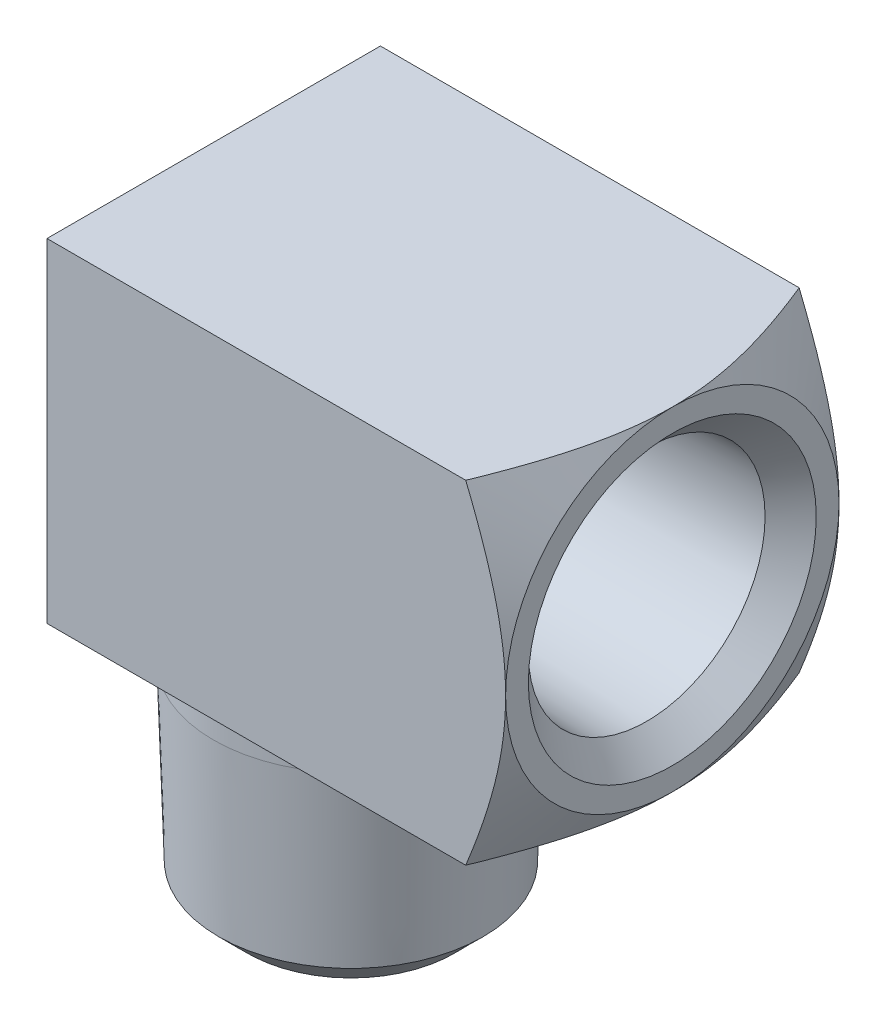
ISO-10303-21;
HEADER;
FILE_DESCRIPTION(('STEP AP214'),'2;1');
FILE_NAME('part.step','',(''),(''),'','','');
FILE_SCHEMA(('AUTOMOTIVE_DESIGN { 1 0 10303 214 1 1 1 1 }'));
ENDSEC;
DATA;
#1=APPLICATION_CONTEXT('core data for automotive mechanical design processes');
#2=APPLICATION_PROTOCOL_DEFINITION('international standard','automotive_design',2000,#1);
#3=PRODUCT_CONTEXT('',#1,'mechanical');
#4=PRODUCT('Part','Part','',(#3));
#5=PRODUCT_RELATED_PRODUCT_CATEGORY('part','',(#4));
#6=PRODUCT_DEFINITION_FORMATION('','',#4);
#7=PRODUCT_DEFINITION_CONTEXT('part definition',#1,'design');
#8=PRODUCT_DEFINITION('design','',#6,#7);
#9=PRODUCT_DEFINITION_SHAPE('','',#8);
#10=(LENGTH_UNIT() NAMED_UNIT(*) SI_UNIT(.MILLI.,.METRE.));
#11=(NAMED_UNIT(*) PLANE_ANGLE_UNIT() SI_UNIT($,.RADIAN.));
#12=(NAMED_UNIT(*) SI_UNIT($,.STERADIAN.) SOLID_ANGLE_UNIT());
#13=UNCERTAINTY_MEASURE_WITH_UNIT(LENGTH_MEASURE(1.E-05),#10,'distance_accuracy_value','');
#14=(GEOMETRIC_REPRESENTATION_CONTEXT(3) GLOBAL_UNCERTAINTY_ASSIGNED_CONTEXT((#13)) GLOBAL_UNIT_ASSIGNED_CONTEXT((#10,
#11,#12)) REPRESENTATION_CONTEXT('',''));
#15=CARTESIAN_POINT('',(0.,0.,0.));
#16=DIRECTION('',(0.,0.,1.));
#17=DIRECTION('',(1.,0.,0.));
#18=AXIS2_PLACEMENT_3D('',#15,#16,#17);
#19=CARTESIAN_POINT('',(0.,8.128,0.));
#20=DIRECTION('',(1.,0.,0.));
#21=DIRECTION('',(0.,0.,1.));
#22=AXIS2_PLACEMENT_3D('',#19,#20,#21);
#23=PLANE('',#22);
#24=CARTESIAN_POINT('',(0.,8.128,0.));
#25=DIRECTION('',(-1.,0.,0.));
#26=DIRECTION('',(0.,0.,-1.));
#27=AXIS2_PLACEMENT_3D('',#24,#25,#26);
#28=CIRCLE('',#27,2.794);
#29=CARTESIAN_POINT('',(-1.26999105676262E-11,8.12800000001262,-2.79399999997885));
#30=VERTEX_POINT('',#29);
#31=CARTESIAN_POINT('',(0.,8.128,2.794));
#32=VERTEX_POINT('',#31);
#33=EDGE_CURVE('E20',#30,#32,#28,.F.);
#34=ORIENTED_EDGE('',*,*,#33,.T.);
#35=DIRECTION('',(0.,0.515038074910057,-0.857167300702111));
#36=VECTOR('',#35,1.);
#37=CARTESIAN_POINT('',(0.,8.96740228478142,1.397));
#38=LINE('',#37,#36);
#39=CARTESIAN_POINT('',(0.,9.80680456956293,0.));
#40=VERTEX_POINT('',#39);
#41=EDGE_CURVE('E69',#32,#40,#38,.T.);
#42=ORIENTED_EDGE('',*,*,#41,.T.);
#43=DIRECTION('',(-7.79516496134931E-12,-0.515038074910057,-0.857167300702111));
#44=VECTOR('',#43,1.);
#45=CARTESIAN_POINT('',(-1.27051147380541E-11,8.96740228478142,-1.397));
#46=LINE('',#45,#44);
#47=EDGE_CURVE('E126',#40,#30,#46,.T.);
#48=ORIENTED_EDGE('',*,*,#47,.T.);
#49=EDGE_LOOP('',(#34,#42,#48));
#50=FACE_BOUND('',#49,.T.);
#51=ADVANCED_FACE('F16',(#50),#23,.T.);
#52=CARTESIAN_POINT('',(12.192,8.128,0.));
#53=DIRECTION('',(-1.,0.,0.));
#54=DIRECTION('',(0.,0.,-1.));
#55=AXIS2_PLACEMENT_3D('',#52,#53,#54);
#56=CYLINDRICAL_SURFACE('',#55,2.794);
#57=CARTESIAN_POINT('',(4.575556,8.128,0.));
#58=DIRECTION('',(-1.,0.,0.));
#59=DIRECTION('',(0.,0.,-1.));
#60=AXIS2_PLACEMENT_3D('',#57,#58,#59);
#61=CIRCLE('',#60,2.794);
#62=CARTESIAN_POINT('',(4.575556,8.128,-2.794));
#63=VERTEX_POINT('',#62);
#64=EDGE_CURVE('E166',#63,#63,#61,.F.);
#65=ORIENTED_EDGE('',*,*,#64,.T.);
#66=EDGE_LOOP('',(#65));
#67=FACE_BOUND('',#66,.T.);
#68=ORIENTED_EDGE('',*,*,#33,.F.);
#69=CARTESIAN_POINT('',(0.,8.128,0.));
#70=DIRECTION('',(-0.707106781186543,-0.707106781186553,0.));
#71=DIRECTION('',(-0.707106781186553,0.707106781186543,0.));
#72=AXIS2_PLACEMENT_3D('',#69,#70,#71);
#73=ELLIPSE('',#72,3.95131269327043,2.794);
#74=EDGE_CURVE('E162',#30,#32,#73,.T.);
#75=ORIENTED_EDGE('',*,*,#74,.T.);
#76=EDGE_LOOP('',(#68,#75));
#77=FACE_BOUND('',#76,.T.);
#78=ADVANCED_FACE('F284',(#67,#77),#56,.F.);
#79=CARTESIAN_POINT('',(0.,8.128,0.));
#80=DIRECTION('',(0.,-1.,0.));
#81=DIRECTION('',(0.,0.,1.));
#82=AXIS2_PLACEMENT_3D('',#79,#80,#81);
#83=CONICAL_SURFACE('',#82,2.794,1.02974425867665);
#84=ORIENTED_EDGE('',*,*,#41,.F.);
#85=CARTESIAN_POINT('',(0.,8.128,0.));
#86=DIRECTION('',(0.,-1.,0.));
#87=DIRECTION('',(0.,0.,1.));
#88=AXIS2_PLACEMENT_3D('',#85,#86,#87);
#89=CIRCLE('',#88,2.794);
#90=EDGE_CURVE('E158',#32,#30,#89,.T.);
#91=ORIENTED_EDGE('',*,*,#90,.T.);
#92=ORIENTED_EDGE('',*,*,#47,.F.);
#93=EDGE_LOOP('',(#84,#91,#92));
#94=FACE_BOUND('',#93,.T.);
#95=ADVANCED_FACE('F290',(#94),#83,.F.);
#96=CARTESIAN_POINT('',(4.575556,3.82269999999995,4.391406));
#97=DIRECTION('',(-1.,0.,0.));
#98=DIRECTION('',(0.,1.,0.));
#99=AXIS2_PLACEMENT_3D('',#96,#97,#98);
#100=PLANE('',#99);
#101=ORIENTED_EDGE('',*,*,#64,.F.);
#102=EDGE_LOOP('',(#101));
#103=FACE_BOUND('',#102,.T.);
#104=CARTESIAN_POINT('',(4.575556,8.128,0.));
#105=DIRECTION('',(-1.,0.,0.));
#106=DIRECTION('',(0.,0.,-1.));
#107=AXIS2_PLACEMENT_3D('',#104,#105,#106);
#108=CIRCLE('',#107,4.3053);
#109=CARTESIAN_POINT('',(4.575556,8.128,-4.3053));
#110=VERTEX_POINT('',#109);
#111=EDGE_CURVE('E161',#110,#110,#108,.F.);
#112=ORIENTED_EDGE('',*,*,#111,.T.);
#113=EDGE_LOOP('',(#112));
#114=FACE_BOUND('',#113,.T.);
#115=ADVANCED_FACE('F286',(#103,#114),#100,.F.);
#116=CARTESIAN_POINT('',(1.09287578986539E-13,-7.62000000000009,0.));
#117=DIRECTION('',(0.,1.,0.));
#118=DIRECTION('',(0.,0.,-1.));
#119=AXIS2_PLACEMENT_3D('',#116,#117,#118);
#120=CYLINDRICAL_SURFACE('',#119,2.794);
#121=CARTESIAN_POINT('',(1.09287578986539E-13,-7.62000000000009,0.));
#122=DIRECTION('',(0.,1.,0.));
#123=DIRECTION('',(0.,0.,-1.));
#124=AXIS2_PLACEMENT_3D('',#121,#122,#123);
#125=CIRCLE('',#124,2.794);
#126=CARTESIAN_POINT('',(1.09287578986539E-13,-7.62000000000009,-2.794));
#127=VERTEX_POINT('',#126);
#128=EDGE_CURVE('E157',#127,#127,#125,.T.);
#129=ORIENTED_EDGE('',*,*,#128,.F.);
#130=EDGE_LOOP('',(#129));
#131=FACE_BOUND('',#130,.T.);
#132=ORIENTED_EDGE('',*,*,#74,.F.);
#133=ORIENTED_EDGE('',*,*,#90,.F.);
#134=EDGE_LOOP('',(#132,#133));
#135=FACE_BOUND('',#134,.T.);
#136=ADVANCED_FACE('F289',(#131,#135),#120,.F.);
#137=CARTESIAN_POINT('',(5.26796,8.128,0.));
#138=DIRECTION('',(-1.,0.,0.));
#139=DIRECTION('',(0.,0.,-1.));
#140=AXIS2_PLACEMENT_3D('',#137,#138,#139);
#141=CYLINDRICAL_SURFACE('',#140,4.3053);
#142=ORIENTED_EDGE('',*,*,#111,.F.);
#143=EDGE_LOOP('',(#142));
#144=FACE_BOUND('',#143,.T.);
#145=CARTESIAN_POINT('',(5.26795999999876,8.128,0.));
#146=DIRECTION('',(1.,0.,0.));
#147=DIRECTION('',(0.,0.,-1.));
#148=AXIS2_PLACEMENT_3D('',#145,#146,#147);
#149=CIRCLE('',#148,4.30530000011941);
#150=CARTESIAN_POINT('',(5.26795999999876,8.128,-4.30530000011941));
#151=VERTEX_POINT('',#150);
#152=EDGE_CURVE('E154',#151,#151,#149,.T.);
#153=ORIENTED_EDGE('',*,*,#152,.T.);
#154=EDGE_LOOP('',(#153));
#155=FACE_BOUND('',#154,.T.);
#156=ADVANCED_FACE('F18',(#144,#155),#141,.F.);
#157=CARTESIAN_POINT('',(1.09287578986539E-13,-7.62000000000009,0.));
#158=DIRECTION('',(0.,-1.,0.));
#159=DIRECTION('',(0.,0.,1.));
#160=AXIS2_PLACEMENT_3D('',#157,#158,#159);
#161=PLANE('',#160);
#162=ORIENTED_EDGE('',*,*,#128,.T.);
#163=EDGE_LOOP('',(#162));
#164=FACE_BOUND('',#163,.T.);
#165=CARTESIAN_POINT('',(1.09287578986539E-13,-7.62000000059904,0.));
#166=DIRECTION('',(0.,1.,0.));
#167=DIRECTION('',(0.,0.,-1.));
#168=AXIS2_PLACEMENT_3D('',#165,#166,#167);
#169=CIRCLE('',#168,3.93700000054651);
#170=CARTESIAN_POINT('',(1.09287578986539E-13,-7.62000000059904,-3.93700000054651));
#171=VERTEX_POINT('',#170);
#172=EDGE_CURVE('E153',#171,#171,#169,.T.);
#173=ORIENTED_EDGE('',*,*,#172,.F.);
#174=EDGE_LOOP('',(#173));
#175=FACE_BOUND('',#174,.T.);
#176=ADVANCED_FACE('F296',(#164,#175),#161,.T.);
#177=CARTESIAN_POINT('',(11.2216335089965,8.128,0.));
#178=DIRECTION('',(1.,0.,0.));
#179=DIRECTION('',(0.,0.,1.));
#180=AXIS2_PLACEMENT_3D('',#177,#178,#179);
#181=CONICAL_SURFACE('',#180,4.49063350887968,0.0311192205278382);
#182=ORIENTED_EDGE('',*,*,#152,.F.);
#183=EDGE_LOOP('',(#182));
#184=FACE_BOUND('',#183,.T.);
#185=CARTESIAN_POINT('',(11.2216335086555,8.128,0.));
#186=DIRECTION('',(1.,0.,0.));
#187=DIRECTION('',(0.,0.,-1.));
#188=AXIS2_PLACEMENT_3D('',#185,#186,#187);
#189=CIRCLE('',#188,4.49063350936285);
#190=CARTESIAN_POINT('',(11.2216335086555,8.128,-4.49063350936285));
#191=VERTEX_POINT('',#190);
#192=EDGE_CURVE('E150',#191,#191,#189,.T.);
#193=ORIENTED_EDGE('',*,*,#192,.T.);
#194=EDGE_LOOP('',(#193));
#195=FACE_BOUND('',#194,.T.);
#196=ADVANCED_FACE('F299',(#184,#195),#181,.F.);
#197=CARTESIAN_POINT('',(1.02348685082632E-13,-6.54688340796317,0.));
#198=DIRECTION('',(0.,1.,0.));
#199=DIRECTION('',(0.,0.,-1.));
#200=AXIS2_PLACEMENT_3D('',#197,#198,#199);
#201=CONICAL_SURFACE('',#200,5.0101165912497,0.785398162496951);
#202=CARTESIAN_POINT('',(1.02348685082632E-13,-6.54688340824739,0.));
#203=DIRECTION('',(0.,1.,0.));
#204=DIRECTION('',(-1.,0.,0.));
#205=AXIS2_PLACEMENT_3D('',#202,#203,#204);
#206=CIRCLE('',#205,5.01011659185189);
#207=CARTESIAN_POINT('',(-5.01011659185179,-6.54688340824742,0.));
#208=VERTEX_POINT('',#207);
#209=EDGE_CURVE('E146',#208,#208,#206,.T.);
#210=ORIENTED_EDGE('',*,*,#209,.F.);
#211=EDGE_LOOP('',(#210));
#212=FACE_BOUND('',#211,.T.);
#213=ORIENTED_EDGE('',*,*,#172,.T.);
#214=EDGE_LOOP('',(#213));
#215=FACE_BOUND('',#214,.T.);
#216=ADVANCED_FACE('F302',(#212,#215),#201,.T.);
#217=CARTESIAN_POINT('',(12.1920000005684,8.128,0.));
#218=DIRECTION('',(1.,0.,0.));
#219=DIRECTION('',(0.,0.,1.));
#220=AXIS2_PLACEMENT_3D('',#217,#218,#219);
#221=CONICAL_SURFACE('',#220,5.4609999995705,0.785398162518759);
#222=ORIENTED_EDGE('',*,*,#192,.F.);
#223=EDGE_LOOP('',(#222));
#224=FACE_BOUND('',#223,.T.);
#225=CARTESIAN_POINT('',(12.1920000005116,8.128,0.));
#226=DIRECTION('',(1.,0.,0.));
#227=DIRECTION('',(0.,0.,1.));
#228=AXIS2_PLACEMENT_3D('',#225,#226,#227);
#229=CIRCLE('',#228,5.46099999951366);
#230=CARTESIAN_POINT('',(12.1920000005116,8.128,5.46099999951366));
#231=VERTEX_POINT('',#230);
#232=EDGE_CURVE('E149',#231,#231,#229,.T.);
#233=ORIENTED_EDGE('',*,*,#232,.T.);
#234=EDGE_LOOP('',(#233));
#235=FACE_BOUND('',#234,.T.);
#236=ADVANCED_FACE('F306',(#224,#235),#221,.F.);
#237=CARTESIAN_POINT('',(0.,0.0226059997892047,0.));
#238=DIRECTION('',(0.,1.,0.));
#239=DIRECTION('',(0.,0.,-1.));
#240=AXIS2_PLACEMENT_3D('',#237,#238,#239);
#241=CONICAL_SURFACE('',#240,5.21461999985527,0.0311192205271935);
#242=CARTESIAN_POINT('',(0.,0.0226059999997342,0.));
#243=DIRECTION('',(0.,-1.,0.));
#244=DIRECTION('',(0.,0.,1.));
#245=AXIS2_PLACEMENT_3D('',#242,#243,#244);
#246=CIRCLE('',#245,5.21462);
#247=CARTESIAN_POINT('',(0.,0.0226059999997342,5.21462));
#248=VERTEX_POINT('',#247);
#249=EDGE_CURVE('E141',#248,#248,#246,.F.);
#250=ORIENTED_EDGE('',*,*,#249,.F.);
#251=EDGE_LOOP('',(#250));
#252=FACE_BOUND('',#251,.T.);
#253=ORIENTED_EDGE('',*,*,#209,.T.);
#254=EDGE_LOOP('',(#253));
#255=FACE_BOUND('',#254,.T.);
#256=ADVANCED_FACE('F309',(#252,#255),#241,.T.);
#257=CARTESIAN_POINT('',(12.192,8.128,0.));
#258=DIRECTION('',(-1.,0.,0.));
#259=DIRECTION('',(0.,0.,-1.));
#260=AXIS2_PLACEMENT_3D('',#257,#258,#259);
#261=PLANE('',#260);
#262=ORIENTED_EDGE('',*,*,#232,.F.);
#263=EDGE_LOOP('',(#262));
#264=FACE_BOUND('',#263,.T.);
#265=CARTESIAN_POINT('',(12.1920000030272,8.128,0.));
#266=DIRECTION('',(-1.,0.,0.));
#267=DIRECTION('',(0.,0.,-1.));
#268=AXIS2_PLACEMENT_3D('',#265,#266,#267);
#269=CIRCLE('',#268,6.32460000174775);
#270=CARTESIAN_POINT('',(12.1920000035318,1.80339999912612,0.));
#271=VERTEX_POINT('',#270);
#272=CARTESIAN_POINT('',(12.1920000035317,8.128,6.32460000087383));
#273=VERTEX_POINT('',#272);
#274=EDGE_CURVE('E234',#271,#273,#269,.T.);
#275=ORIENTED_EDGE('',*,*,#274,.F.);
#276=CARTESIAN_POINT('',(12.1920000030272,8.128,0.));
#277=DIRECTION('',(-1.,0.,0.));
#278=DIRECTION('',(0.,0.,-1.));
#279=AXIS2_PLACEMENT_3D('',#276,#277,#278);
#280=CIRCLE('',#279,6.32460000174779);
#281=CARTESIAN_POINT('',(12.1920000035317,8.128,-6.32460000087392));
#282=VERTEX_POINT('',#281);
#283=EDGE_CURVE('E145',#282,#271,#280,.T.);
#284=ORIENTED_EDGE('',*,*,#283,.F.);
#285=CARTESIAN_POINT('',(12.1920000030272,8.128,0.));
#286=DIRECTION('',(-1.,0.,0.));
#287=DIRECTION('',(0.,0.,-1.));
#288=AXIS2_PLACEMENT_3D('',#285,#286,#287);
#289=CIRCLE('',#288,6.32460000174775);
#290=CARTESIAN_POINT('',(12.1920000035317,14.4526000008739,0.));
#291=VERTEX_POINT('',#290);
#292=EDGE_CURVE('E267',#291,#282,#289,.T.);
#293=ORIENTED_EDGE('',*,*,#292,.F.);
#294=CARTESIAN_POINT('',(12.1920000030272,8.128,0.));
#295=DIRECTION('',(-1.,0.,0.));
#296=DIRECTION('',(0.,0.,-1.));
#297=AXIS2_PLACEMENT_3D('',#294,#295,#296);
#298=CIRCLE('',#297,6.32460000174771);
#299=EDGE_CURVE('E216',#273,#291,#298,.T.);
#300=ORIENTED_EDGE('',*,*,#299,.F.);
#301=EDGE_LOOP('',(#275,#284,#293,#300));
#302=FACE_BOUND('',#301,.T.);
#303=ADVANCED_FACE('F224',(#264,#302),#261,.F.);
#304=CARTESIAN_POINT('',(10.670420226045,8.128,0.));
#305=DIRECTION('',(-1.,0.,0.));
#306=DIRECTION('',(0.,0.,-1.));
#307=AXIS2_PLACEMENT_3D('',#304,#305,#306);
#308=CONICAL_SURFACE('',#307,8.96005347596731,1.04719755);
#309=CARTESIAN_POINT('',(12.1920000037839,14.4525999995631,0.));
#310=CARTESIAN_POINT('',(12.1920489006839,14.4525999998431,-0.182578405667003));
#311=CARTESIAN_POINT('',(12.1874365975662,14.452599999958,-0.365140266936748));
#312=CARTESIAN_POINT('',(12.1692563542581,14.452600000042,-0.729748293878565));
#313=CARTESIAN_POINT('',(12.1556919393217,14.4526000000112,-0.911794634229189));
#314=CARTESIAN_POINT('',(12.1200296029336,14.4525999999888,-1.27446486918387));
#315=CARTESIAN_POINT('',(12.0979585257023,14.452599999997,-1.45509143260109));
#316=CARTESIAN_POINT('',(12.0459151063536,14.452600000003,-1.81520931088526));
#317=CARTESIAN_POINT('',(12.015942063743,14.4526000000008,-1.99470052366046));
#318=CARTESIAN_POINT('',(11.9491843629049,14.4525999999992,-2.35048281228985));
#319=CARTESIAN_POINT('',(11.912473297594,14.4525999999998,-2.52678779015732));
#320=CARTESIAN_POINT('',(11.8328073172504,14.4526000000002,-2.87796628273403));
#321=CARTESIAN_POINT('',(11.7898524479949,14.4526000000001,-3.05283980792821));
#322=CARTESIAN_POINT('',(11.6527103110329,14.4525999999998,-3.57552325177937));
#323=CARTESIAN_POINT('',(11.5502864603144,14.4526,-3.92118732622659));
#324=CARTESIAN_POINT('',(11.3835132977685,14.4526,-4.43788492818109));
#325=CARTESIAN_POINT('',(11.325299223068,14.4526,-4.61096638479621));
#326=CARTESIAN_POINT('',(11.2052088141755,14.4526,-4.95578959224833));
#327=CARTESIAN_POINT('',(11.1433338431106,14.4526,-5.1275318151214));
#328=CARTESIAN_POINT('',(11.0160725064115,14.4526,-5.47076757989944));
#329=CARTESIAN_POINT('',(10.9506688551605,14.4526,-5.64225467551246));
#330=CARTESIAN_POINT('',(10.8170678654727,14.4526,-5.98419033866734));
#331=CARTESIAN_POINT('',(10.7488697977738,14.4526,-6.15463862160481));
#332=CARTESIAN_POINT('',(10.6794952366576,14.4526,-6.32459999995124));
#333=B_SPLINE_CURVE_WITH_KNOTS('',3,(#309,#310,#311,#312,#313,#314,#315,#316,#317,#318,#319,
#320,#321,#322,#323,#324,#325,#326,#327,#328,#329,#330,#331,#332),.UNSPECIFIED.,.F.,.F.,(4,2,2,
2,2,2,2,2,2,2,2,4),(0.,0.547650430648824,1.09508533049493,1.64080666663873,2.186576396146,
2.72670608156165,3.26683180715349,4.34772009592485,4.89552487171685,5.44312694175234,
5.9937108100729,6.54443929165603),.UNSPECIFIED.);
#334=CARTESIAN_POINT('',(10.679495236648,14.4525999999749,-6.3246));
#335=VERTEX_POINT('',#334);
#336=EDGE_CURVE('E138',#291,#335,#333,.T.);
#337=ORIENTED_EDGE('',*,*,#336,.F.);
#338=ORIENTED_EDGE('',*,*,#292,.T.);
#339=CARTESIAN_POINT('',(10.6794952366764,14.4525999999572,-6.32460000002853));
#340=CARTESIAN_POINT('',(10.7311085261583,14.326167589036,-6.32460000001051));
#341=CARTESIAN_POINT('',(10.7820630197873,14.1994665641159,-6.32460000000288));
#342=CARTESIAN_POINT('',(10.8824952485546,13.9454736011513,-6.32459999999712));
#343=CARTESIAN_POINT('',(10.9319729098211,13.8181816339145,-6.32459999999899));
#344=CARTESIAN_POINT('',(11.0779906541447,13.4352359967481,-6.32460000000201));
#345=CARTESIAN_POINT('',(11.1720659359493,13.1786331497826,-6.32460000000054));
#346=CARTESIAN_POINT('',(11.3511657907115,12.6650014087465,-6.32459999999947));
#347=CARTESIAN_POINT('',(11.4362677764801,12.407999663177,-6.32459999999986));
#348=CARTESIAN_POINT('',(11.596464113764,11.8908727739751,-6.32460000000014));
#349=CARTESIAN_POINT('',(11.6715587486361,11.6307477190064,-6.32460000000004));
#350=CARTESIAN_POINT('',(11.8097793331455,11.1057877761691,-6.32459999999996));
#351=CARTESIAN_POINT('',(11.8728378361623,10.8409349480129,-6.32459999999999));
#352=CARTESIAN_POINT('',(11.9838110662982,10.3081038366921,-6.32460000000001));
#353=CARTESIAN_POINT('',(12.0317314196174,10.0401267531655,-6.3246));
#354=CARTESIAN_POINT('',(12.090540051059,9.63501789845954,-6.3246));
#355=CARTESIAN_POINT('',(12.1080139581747,9.4988247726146,-6.3246));
#356=CARTESIAN_POINT('',(12.1381962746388,9.22590894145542,-6.3246));
#357=CARTESIAN_POINT('',(12.150904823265,9.08918625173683,-6.3246));
#358=CARTESIAN_POINT('',(12.1713488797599,8.81515971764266,-6.3246));
#359=CARTESIAN_POINT('',(12.1790768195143,8.67785530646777,-6.3246));
#360=CARTESIAN_POINT('',(12.1894108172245,8.4030354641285,-6.3246));
#361=CARTESIAN_POINT('',(12.1920161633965,8.26552000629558,-6.3246));
#362=CARTESIAN_POINT('',(12.1920000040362,8.12800000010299,-6.3246));
#363=B_SPLINE_CURVE_WITH_KNOTS('',3,(#339,#340,#341,#342,#343,#344,#345,#346,#347,#348,#349,
#350,#351,#352,#353,#354,#355,#356,#357,#358,#359,#360,#361,#362),.UNSPECIFIED.,.F.,.F.,(4,2,2,
2,2,2,2,2,2,2,2,4),(0.,0.409681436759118,0.819383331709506,1.6391780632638,2.45119361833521,
3.2631861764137,4.07960325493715,4.8957165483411,5.30757479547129,5.71942100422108,
6.13189155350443,6.5444194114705),.UNSPECIFIED.);
#364=EDGE_CURVE('E229',#335,#282,#363,.T.);
#365=ORIENTED_EDGE('',*,*,#364,.F.);
#366=EDGE_LOOP('',(#337,#338,#365));
#367=FACE_BOUND('',#366,.T.);
#368=ADVANCED_FACE('F218',(#367),#308,.T.);
#369=CARTESIAN_POINT('',(0.,1.80339999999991,0.));
#370=DIRECTION('',(0.,1.,0.));
#371=DIRECTION('',(0.,0.,-1.));
#372=AXIS2_PLACEMENT_3D('',#369,#370,#371);
#373=PLANE('',#372);
#374=DIRECTION('',(0.,0.,1.));
#375=VECTOR('',#374,1.);
#376=CARTESIAN_POINT('',(-5.207,1.80339999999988,-6.3246));
#377=LINE('',#376,#375);
#378=CARTESIAN_POINT('',(-5.207,1.80339999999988,-0.281802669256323));
#379=VERTEX_POINT('',#378);
#380=CARTESIAN_POINT('',(-5.207,1.80339999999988,0.281802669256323));
#381=VERTEX_POINT('',#380);
#382=EDGE_CURVE('E114',#379,#381,#377,.T.);
#383=ORIENTED_EDGE('',*,*,#382,.F.);
#384=CARTESIAN_POINT('',(0.,1.80339999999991,0.));
#385=DIRECTION('',(0.,-1.,0.));
#386=DIRECTION('',(0.,0.,1.));
#387=AXIS2_PLACEMENT_3D('',#384,#385,#386);
#388=CIRCLE('',#387,5.21462);
#389=EDGE_CURVE('E144',#381,#379,#388,.T.);
#390=ORIENTED_EDGE('',*,*,#389,.F.);
#391=EDGE_LOOP('',(#383,#390));
#392=FACE_BOUND('',#391,.T.);
#393=ADVANCED_FACE('F223',(#392),#373,.T.);
#394=CARTESIAN_POINT('',(10.670420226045,8.128,0.));
#395=DIRECTION('',(-1.,0.,0.));
#396=DIRECTION('',(0.,0.,-1.));
#397=AXIS2_PLACEMENT_3D('',#394,#395,#396);
#398=CONICAL_SURFACE('',#397,8.9600534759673,1.04719755);
#399=CARTESIAN_POINT('',(12.192000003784,8.128,-6.32459999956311));
#400=CARTESIAN_POINT('',(12.192048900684,7.94542159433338,-6.32459999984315));
#401=CARTESIAN_POINT('',(12.1874365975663,7.76285973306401,-6.32459999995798));
#402=CARTESIAN_POINT('',(12.1692563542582,7.39825170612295,-6.324600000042));
#403=CARTESIAN_POINT('',(12.1556919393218,7.2162053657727,-6.32460000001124));
#404=CARTESIAN_POINT('',(12.1200296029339,6.8535351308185,-6.3245999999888));
#405=CARTESIAN_POINT('',(12.0979585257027,6.67290856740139,-6.324599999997));
#406=CARTESIAN_POINT('',(12.0459151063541,6.31279068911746,-6.324600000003));
#407=CARTESIAN_POINT('',(12.0159420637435,6.13329947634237,-6.3246000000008));
#408=CARTESIAN_POINT('',(11.9491843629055,5.77751718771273,-6.32459999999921));
#409=CARTESIAN_POINT('',(11.9124732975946,5.6012122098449,-6.32459999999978));
#410=CARTESIAN_POINT('',(11.8328073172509,5.25003371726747,-6.32460000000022));
#411=CARTESIAN_POINT('',(11.7898524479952,5.07516019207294,-6.32460000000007));
#412=CARTESIAN_POINT('',(11.6527103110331,4.55247674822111,-6.32459999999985));
#413=CARTESIAN_POINT('',(11.5502864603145,4.20681267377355,-6.32459999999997));
#414=CARTESIAN_POINT('',(11.3835132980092,3.69011507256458,-6.32460000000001));
#415=CARTESIAN_POINT('',(11.3252992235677,3.51703361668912,-6.3246));
#416=CARTESIAN_POINT('',(11.205208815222,3.17221041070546,-6.3246));
#417=CARTESIAN_POINT('',(11.143333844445,3.0004681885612,-6.3246));
#418=CARTESIAN_POINT('',(11.0160725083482,2.65723242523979,-6.3246));
#419=CARTESIAN_POINT('',(10.9506688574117,2.48574533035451,-6.3246));
#420=CARTESIAN_POINT('',(10.8170678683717,2.14380966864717,-6.3246));
#421=CARTESIAN_POINT('',(10.7488698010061,1.97336138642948,-6.3246));
#422=CARTESIAN_POINT('',(10.6794952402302,1.80340000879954,-6.3246));
#423=B_SPLINE_CURVE_WITH_KNOTS('',3,(#399,#400,#401,#402,#403,#404,#405,#406,#407,#408,#409,
#410,#411,#412,#413,#414,#415,#416,#417,#418,#419,#420,#421,#422),.UNSPECIFIED.,.F.,.F.,(4,2,2,
2,2,2,2,2,2,2,2,4),(0.,0.547650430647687,1.09508533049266,1.64080666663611,2.18657639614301,
2.72670608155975,3.26683180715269,4.34772009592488,4.89552486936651,5.44312693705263,
5.99371080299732,6.54443928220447),.UNSPECIFIED.);
#424=CARTESIAN_POINT('',(10.6794952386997,1.80340000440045,-6.32459999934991));
#425=VERTEX_POINT('',#424);
#426=EDGE_CURVE('E100',#282,#425,#423,.T.);
#427=ORIENTED_EDGE('',*,*,#426,.F.);
#428=ORIENTED_EDGE('',*,*,#283,.T.);
#429=CARTESIAN_POINT('',(10.6794952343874,1.80340000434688,-6.32459999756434));
#430=CARTESIAN_POINT('',(10.7311085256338,1.80340000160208,-6.19816758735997));
#431=CARTESIAN_POINT('',(10.7820630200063,1.8034000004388,-6.07146656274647));
#432=CARTESIAN_POINT('',(10.8824952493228,1.80339999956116,-5.81747360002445));
#433=CARTESIAN_POINT('',(10.9319729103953,1.80339999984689,-5.69018163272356));
#434=CARTESIAN_POINT('',(11.0779906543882,1.80340000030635,-5.30723599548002));
#435=CARTESIAN_POINT('',(11.1720659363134,1.80340000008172,-5.05063314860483));
#436=CARTESIAN_POINT('',(11.3511657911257,1.80339999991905,-4.53700140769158));
#437=CARTESIAN_POINT('',(11.4362677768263,1.8033999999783,-4.27999966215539));
#438=CARTESIAN_POINT('',(11.5964641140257,1.80340000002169,-3.76287277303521));
#439=CARTESIAN_POINT('',(11.6715587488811,1.80340000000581,-3.50274771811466));
#440=CARTESIAN_POINT('',(11.8097793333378,1.80339999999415,-2.97778777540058));
#441=CARTESIAN_POINT('',(11.8728378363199,1.80339999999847,-2.71293494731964));
#442=CARTESIAN_POINT('',(11.9838110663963,1.80340000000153,-2.18010383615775));
#443=CARTESIAN_POINT('',(12.0317314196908,1.80340000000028,-1.9121267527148));
#444=CARTESIAN_POINT('',(12.0905400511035,1.80339999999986,-1.50701789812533));
#445=CARTESIAN_POINT('',(12.1080139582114,1.80339999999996,-1.37082477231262));
#446=CARTESIAN_POINT('',(12.1381962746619,1.80340000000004,-1.09790894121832));
#447=CARTESIAN_POINT('',(12.1509048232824,1.80340000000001,-0.961186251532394));
#448=CARTESIAN_POINT('',(12.1713488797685,1.80339999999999,-0.687159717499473));
#449=CARTESIAN_POINT('',(12.1790768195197,1.80339999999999,-0.549855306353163));
#450=CARTESIAN_POINT('',(12.1894108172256,1.80340000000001,-0.275035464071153));
#451=CARTESIAN_POINT('',(12.1920161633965,1.80340000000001,-0.137520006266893));
#452=CARTESIAN_POINT('',(12.1920000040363,1.8034,-1.02986989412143E-10));
#453=B_SPLINE_CURVE_WITH_KNOTS('',3,(#429,#430,#431,#432,#433,#434,#435,#436,#437,#438,#439,
#440,#441,#442,#443,#444,#445,#446,#447,#448,#449,#450,#451,#452),.UNSPECIFIED.,.F.,.F.,(4,2,2,
2,2,2,2,2,2,2,2,4),(0.,0.40968143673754,0.819383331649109,1.63917806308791,2.45119361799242,
3.26318617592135,4.07960325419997,4.89571654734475,5.30757479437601,5.71942100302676,
6.13189155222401,6.54441941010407),.UNSPECIFIED.);
#454=EDGE_CURVE('E204',#425,#271,#453,.T.);
#455=ORIENTED_EDGE('',*,*,#454,.F.);
#456=EDGE_LOOP('',(#427,#428,#455));
#457=FACE_BOUND('',#456,.T.);
#458=ADVANCED_FACE('F245',(#457),#398,.T.);
#459=CARTESIAN_POINT('',(0.,1.80339999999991,0.));
#460=DIRECTION('',(0.,-1.,0.));
#461=DIRECTION('',(0.,0.,1.));
#462=AXIS2_PLACEMENT_3D('',#459,#460,#461);
#463=CYLINDRICAL_SURFACE('',#462,5.21462);
#464=ORIENTED_EDGE('',*,*,#249,.T.);
#465=EDGE_LOOP('',(#464));
#466=FACE_BOUND('',#465,.T.);
#467=CARTESIAN_POINT('',(0.,1.80339999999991,0.));
#468=DIRECTION('',(0.,-1.,0.));
#469=DIRECTION('',(0.,0.,1.));
#470=AXIS2_PLACEMENT_3D('',#467,#468,#469);
#471=CIRCLE('',#470,5.21462);
#472=EDGE_CURVE('E104',#381,#379,#471,.F.);
#473=ORIENTED_EDGE('',*,*,#472,.F.);
#474=ORIENTED_EDGE('',*,*,#389,.T.);
#475=EDGE_LOOP('',(#473,#474));
#476=FACE_BOUND('',#475,.T.);
#477=ADVANCED_FACE('F242',(#466,#476),#463,.T.);
#478=CARTESIAN_POINT('',(12.192,1.8034,-6.3246));
#479=DIRECTION('',(0.,0.,-1.));
#480=DIRECTION('',(1.,0.,0.));
#481=AXIS2_PLACEMENT_3D('',#478,#479,#480);
#482=PLANE('',#481);
#483=DIRECTION('',(-1.,0.,0.));
#484=VECTOR('',#483,1.);
#485=CARTESIAN_POINT('',(12.192,14.4526,-6.3246));
#486=LINE('',#485,#484);
#487=CARTESIAN_POINT('',(-5.207,14.4525999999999,-6.3246));
#488=VERTEX_POINT('',#487);
#489=EDGE_CURVE('E136',#335,#488,#486,.T.);
#490=ORIENTED_EDGE('',*,*,#489,.F.);
#491=ORIENTED_EDGE('',*,*,#364,.T.);
#492=ORIENTED_EDGE('',*,*,#426,.T.);
#493=DIRECTION('',(-1.,0.,0.));
#494=VECTOR('',#493,1.);
#495=CARTESIAN_POINT('',(12.192,1.8034,-6.3246));
#496=LINE('',#495,#494);
#497=CARTESIAN_POINT('',(-5.207,1.80339999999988,-6.3246));
#498=VERTEX_POINT('',#497);
#499=EDGE_CURVE('E92',#498,#425,#496,.F.);
#500=ORIENTED_EDGE('',*,*,#499,.F.);
#501=DIRECTION('',(0.,-1.,0.));
#502=VECTOR('',#501,1.);
#503=CARTESIAN_POINT('',(-5.207,14.4525999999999,-6.3246));
#504=LINE('',#503,#502);
#505=EDGE_CURVE('E97',#488,#498,#504,.T.);
#506=ORIENTED_EDGE('',*,*,#505,.F.);
#507=EDGE_LOOP('',(#490,#491,#492,#500,#506));
#508=FACE_BOUND('',#507,.T.);
#509=ADVANCED_FACE('F95',(#508),#482,.T.);
#510=CARTESIAN_POINT('',(10.6704202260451,8.128,0.));
#511=DIRECTION('',(-1.,0.,0.));
#512=DIRECTION('',(0.,0.,-1.));
#513=AXIS2_PLACEMENT_3D('',#510,#511,#512);
#514=CONICAL_SURFACE('',#513,8.96005347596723,1.04719755);
#515=ORIENTED_EDGE('',*,*,#274,.T.);
#516=CARTESIAN_POINT('',(10.679495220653,1.80340001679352,6.32459996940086));
#517=CARTESIAN_POINT('',(10.7311085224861,1.92983242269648,6.32459998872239));
#518=CARTESIAN_POINT('',(10.7820630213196,2.05653344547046,6.32459999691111));
#519=CARTESIAN_POINT('',(10.8824952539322,2.31052640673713,6.32460000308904));
#520=CARTESIAN_POINT('',(10.9319729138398,2.43781837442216,6.32460000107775));
#521=CARTESIAN_POINT('',(11.0779906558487,2.82076401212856,6.32459999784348));
#522=CARTESIAN_POINT('',(11.1720659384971,3.07736685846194,6.32459999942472));
#523=CARTESIAN_POINT('',(11.3511657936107,3.59099859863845,6.32460000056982));
#524=CARTESIAN_POINT('',(11.4362677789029,3.84800034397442,6.32460000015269));
#525=CARTESIAN_POINT('',(11.5964641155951,4.36512723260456,6.32459999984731));
#526=CARTESIAN_POINT('',(11.6715587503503,4.62525228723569,6.32459999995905));
#527=CARTESIAN_POINT('',(11.8097793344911,5.15021222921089,6.32460000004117));
#528=CARTESIAN_POINT('',(11.8728378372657,5.4150650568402,6.32460000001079));
#529=CARTESIAN_POINT('',(11.9838110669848,5.94789616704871,6.32459999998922));
#530=CARTESIAN_POINT('',(12.0317314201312,6.21587324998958,6.32459999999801));
#531=CARTESIAN_POINT('',(12.0905400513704,6.62098210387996,6.324600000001));
#532=CARTESIAN_POINT('',(12.1080139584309,6.75717522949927,6.32460000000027));
#533=CARTESIAN_POINT('',(12.1381962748,7.03009106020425,6.32459999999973));
#534=CARTESIAN_POINT('',(12.1509048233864,7.16681374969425,6.32459999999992));
#535=CARTESIAN_POINT('',(12.1713488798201,7.44084028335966,6.32460000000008));
#536=CARTESIAN_POINT('',(12.179076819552,7.57814469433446,6.32460000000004));
#537=CARTESIAN_POINT('',(12.189410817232,7.85296453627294,6.32459999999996));
#538=CARTESIAN_POINT('',(12.1920161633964,7.99047999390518,6.32459999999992));
#539=CARTESIAN_POINT('',(12.1920000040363,8.12799999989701,6.3246));
#540=B_SPLINE_CURVE_WITH_KNOTS('',3,(#516,#517,#518,#519,#520,#521,#522,#523,#524,#525,#526,
#527,#528,#529,#530,#531,#532,#533,#534,#535,#536,#537,#538,#539),.UNSPECIFIED.,.F.,.F.,(4,2,2,
2,2,2,2,2,2,2,2,4),(0.,0.409681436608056,0.819383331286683,1.63917806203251,2.45119361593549,
3.26318617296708,4.07960324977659,4.89571654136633,5.30757478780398,5.71942099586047,
6.13189154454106,6.5444194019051),.UNSPECIFIED.);
#541=CARTESIAN_POINT('',(10.6794952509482,1.80340000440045,6.32459996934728));
#542=VERTEX_POINT('',#541);
#543=EDGE_CURVE('E103',#542,#273,#540,.T.);
#544=ORIENTED_EDGE('',*,*,#543,.F.);
#545=CARTESIAN_POINT('',(12.192000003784,1.80340000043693,0.));
#546=CARTESIAN_POINT('',(12.192048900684,1.80340000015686,0.182578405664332));
#547=CARTESIAN_POINT('',(12.1874365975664,1.80340000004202,0.365140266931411));
#548=CARTESIAN_POINT('',(12.1692563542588,1.803399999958,0.729748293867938));
#549=CARTESIAN_POINT('',(12.1556919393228,1.80339999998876,0.911794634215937));
#550=CARTESIAN_POINT('',(12.1200296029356,1.8034000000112,1.27446486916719));
#551=CARTESIAN_POINT('',(12.0979585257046,1.803400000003,1.4550914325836));
#552=CARTESIAN_POINT('',(12.0459151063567,1.803399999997,1.81520931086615));
#553=CARTESIAN_POINT('',(12.0159420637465,1.8033999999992,1.99470052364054));
#554=CARTESIAN_POINT('',(11.9491843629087,1.80340000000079,2.35048281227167));
#555=CARTESIAN_POINT('',(11.9124732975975,1.80340000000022,2.52678779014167));
#556=CARTESIAN_POINT('',(11.8328073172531,1.80339999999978,2.87796628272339));
#557=CARTESIAN_POINT('',(11.789852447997,1.80339999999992,3.05283980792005));
#558=CARTESIAN_POINT('',(11.652710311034,1.80340000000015,3.5755232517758));
#559=CARTESIAN_POINT('',(11.5502864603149,1.80340000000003,3.92118732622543));
#560=CARTESIAN_POINT('',(11.3835132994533,1.80339999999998,4.43788492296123));
#561=CARTESIAN_POINT('',(11.3252992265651,1.80339999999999,4.61096637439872));
#562=CARTESIAN_POINT('',(11.2052088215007,1.8034,4.95578957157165));
#563=CARTESIAN_POINT('',(11.1433338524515,1.80339999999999,5.12753178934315));
#564=CARTESIAN_POINT('',(11.0160725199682,1.80339999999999,5.47076754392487));
#565=CARTESIAN_POINT('',(10.9506688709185,1.80339999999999,5.64225463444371));
#566=CARTESIAN_POINT('',(10.817067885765,1.80339999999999,5.98419028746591));
#567=CARTESIAN_POINT('',(10.7488698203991,1.80339999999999,6.15463856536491));
#568=CARTESIAN_POINT('',(10.6794952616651,1.8034,6.32459993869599));
#569=B_SPLINE_CURVE_WITH_KNOTS('',3,(#545,#546,#547,#548,#549,#550,#551,#552,#553,#554,#555,
#556,#557,#558,#559,#560,#561,#562,#563,#564,#565,#566,#567,#568),.UNSPECIFIED.,.F.,.F.,(4,2,2,
2,2,2,2,2,2,2,2,4),(0.,0.54765043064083,1.095085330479,1.64080666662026,2.18657639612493,
2.72670608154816,3.26683180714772,4.34772009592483,4.89552485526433,5.44312690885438,
5.99371076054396,6.54443922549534),.UNSPECIFIED.);
#570=EDGE_CURVE('E319',#271,#542,#569,.T.);
#571=ORIENTED_EDGE('',*,*,#570,.F.);
#572=EDGE_LOOP('',(#515,#544,#571));
#573=FACE_BOUND('',#572,.T.);
#574=ADVANCED_FACE('F193',(#573),#514,.T.);
#575=CARTESIAN_POINT('',(10.6704202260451,8.128,0.));
#576=DIRECTION('',(-1.,0.,0.));
#577=DIRECTION('',(0.,0.,-1.));
#578=AXIS2_PLACEMENT_3D('',#575,#576,#577);
#579=CONICAL_SURFACE('',#578,8.96005347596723,1.04719755);
#580=ORIENTED_EDGE('',*,*,#299,.T.);
#581=CARTESIAN_POINT('',(10.6794952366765,14.4526000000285,6.3245999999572));
#582=CARTESIAN_POINT('',(10.7311085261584,14.4526000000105,6.19816758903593));
#583=CARTESIAN_POINT('',(10.7820630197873,14.4526000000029,6.07146656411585));
#584=CARTESIAN_POINT('',(10.8824952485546,14.4525999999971,5.81747360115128));
#585=CARTESIAN_POINT('',(10.9319729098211,14.452599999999,5.69018163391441));
#586=CARTESIAN_POINT('',(11.0779906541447,14.452600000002,5.30723599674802));
#587=CARTESIAN_POINT('',(11.1720659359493,14.4526000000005,5.05063314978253));
#588=CARTESIAN_POINT('',(11.3511657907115,14.4525999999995,4.5370014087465));
#589=CARTESIAN_POINT('',(11.4362677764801,14.4525999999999,4.27999966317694));
#590=CARTESIAN_POINT('',(11.596464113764,14.4526000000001,3.7628727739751));
#591=CARTESIAN_POINT('',(11.6715587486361,14.4526,3.50274771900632));
#592=CARTESIAN_POINT('',(11.8097793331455,14.4526,2.9777877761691));
#593=CARTESIAN_POINT('',(11.8728378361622,14.4526,2.71293494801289));
#594=CARTESIAN_POINT('',(11.9838110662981,14.4526,2.18010383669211));
#595=CARTESIAN_POINT('',(12.0317314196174,14.4526,1.91212675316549));
#596=CARTESIAN_POINT('',(12.0905400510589,14.4526,1.50701789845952));
#597=CARTESIAN_POINT('',(12.1080139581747,14.4526,1.37082477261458));
#598=CARTESIAN_POINT('',(12.1381962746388,14.4526,1.09790894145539));
#599=CARTESIAN_POINT('',(12.1509048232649,14.4526,0.961186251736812));
#600=CARTESIAN_POINT('',(12.1713488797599,14.4526,0.687159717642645));
#601=CARTESIAN_POINT('',(12.1790768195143,14.4526,0.549855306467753));
#602=CARTESIAN_POINT('',(12.1894108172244,14.4526,0.275035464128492));
#603=CARTESIAN_POINT('',(12.1920161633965,14.4526,0.137520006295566));
#604=CARTESIAN_POINT('',(12.1920000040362,14.4526,1.02983346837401E-10));
#605=B_SPLINE_CURVE_WITH_KNOTS('',3,(#581,#582,#583,#584,#585,#586,#587,#588,#589,#590,#591,
#592,#593,#594,#595,#596,#597,#598,#599,#600,#601,#602,#603,#604),.UNSPECIFIED.,.F.,.F.,(4,2,2,
2,2,2,2,2,2,2,2,4),(0.,0.409681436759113,0.819383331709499,1.63917806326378,2.4511936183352,
3.26318617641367,4.07960325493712,4.89571654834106,5.30757479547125,5.71942100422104,
6.13189155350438,6.54441941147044),.UNSPECIFIED.);
#606=CARTESIAN_POINT('',(10.679495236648,14.4526,6.32459999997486));
#607=VERTEX_POINT('',#606);
#608=EDGE_CURVE('E35',#607,#291,#605,.T.);
#609=ORIENTED_EDGE('',*,*,#608,.F.);
#610=CARTESIAN_POINT('',(12.192000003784,8.128,6.32459999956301));
#611=CARTESIAN_POINT('',(12.192048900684,8.31057840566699,6.32459999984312));
#612=CARTESIAN_POINT('',(12.1874365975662,8.49314026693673,6.32459999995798));
#613=CARTESIAN_POINT('',(12.1692563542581,8.85774829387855,6.32460000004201));
#614=CARTESIAN_POINT('',(12.1556919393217,9.03979463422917,6.32460000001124));
#615=CARTESIAN_POINT('',(12.1200296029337,9.40246486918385,6.32459999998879));
#616=CARTESIAN_POINT('',(12.0979585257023,9.58309143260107,6.324599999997));
#617=CARTESIAN_POINT('',(12.0459151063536,9.94320931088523,6.324600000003));
#618=CARTESIAN_POINT('',(12.015942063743,10.1227005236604,6.3246000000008));
#619=CARTESIAN_POINT('',(11.9491843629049,10.4784828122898,6.32459999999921));
#620=CARTESIAN_POINT('',(11.9124732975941,10.6547877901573,6.32459999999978));
#621=CARTESIAN_POINT('',(11.8328073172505,11.005966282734,6.32460000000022));
#622=CARTESIAN_POINT('',(11.7898524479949,11.1808398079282,6.32460000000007));
#623=CARTESIAN_POINT('',(11.6527103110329,11.7035232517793,6.32459999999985));
#624=CARTESIAN_POINT('',(11.5502864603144,12.0491873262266,6.32459999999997));
#625=CARTESIAN_POINT('',(11.3835132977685,12.565884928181,6.32460000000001));
#626=CARTESIAN_POINT('',(11.3252992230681,12.7389663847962,6.3246));
#627=CARTESIAN_POINT('',(11.2052088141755,13.0837895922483,6.3246));
#628=CARTESIAN_POINT('',(11.1433338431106,13.2555318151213,6.3246));
#629=CARTESIAN_POINT('',(11.0160725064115,13.5987675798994,6.3246));
#630=CARTESIAN_POINT('',(10.9506688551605,13.7702546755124,6.3246));
#631=CARTESIAN_POINT('',(10.8170678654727,14.1121903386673,6.3246));
#632=CARTESIAN_POINT('',(10.7488697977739,14.2826386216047,6.3246));
#633=CARTESIAN_POINT('',(10.6794952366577,14.4525999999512,6.3246));
#634=B_SPLINE_CURVE_WITH_KNOTS('',3,(#610,#611,#612,#613,#614,#615,#616,#617,#618,#619,#620,
#621,#622,#623,#624,#625,#626,#627,#628,#629,#630,#631,#632,#633),.UNSPECIFIED.,.F.,.F.,(4,2,2,
2,2,2,2,2,2,2,2,4),(0.,0.547650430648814,1.09508533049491,1.64080666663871,2.18657639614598,
2.72670608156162,3.26683180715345,4.3477200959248,4.8955248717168,5.44312694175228,
5.99371081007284,6.54443929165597),.UNSPECIFIED.);
#635=EDGE_CURVE('E131',#273,#607,#634,.T.);
#636=ORIENTED_EDGE('',*,*,#635,.F.);
#637=EDGE_LOOP('',(#580,#609,#636));
#638=FACE_BOUND('',#637,.T.);
#639=ADVANCED_FACE('F188',(#638),#579,.T.);
#640=CARTESIAN_POINT('',(12.192,14.4526,-6.3246));
#641=DIRECTION('',(0.,1.,0.));
#642=DIRECTION('',(0.,0.,-1.));
#643=AXIS2_PLACEMENT_3D('',#640,#641,#642);
#644=PLANE('',#643);
#645=DIRECTION('',(-1.,0.,0.));
#646=VECTOR('',#645,1.);
#647=CARTESIAN_POINT('',(12.192,14.4526,6.3246));
#648=LINE('',#647,#646);
#649=CARTESIAN_POINT('',(-5.207,14.4525999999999,6.3246));
#650=VERTEX_POINT('',#649);
#651=EDGE_CURVE('E26',#607,#650,#648,.T.);
#652=ORIENTED_EDGE('',*,*,#651,.F.);
#653=ORIENTED_EDGE('',*,*,#608,.T.);
#654=ORIENTED_EDGE('',*,*,#336,.T.);
#655=ORIENTED_EDGE('',*,*,#489,.T.);
#656=DIRECTION('',(0.,0.,-1.));
#657=VECTOR('',#656,1.);
#658=CARTESIAN_POINT('',(-5.207,14.4525999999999,6.3246));
#659=LINE('',#658,#657);
#660=EDGE_CURVE('E121',#650,#488,#659,.T.);
#661=ORIENTED_EDGE('',*,*,#660,.F.);
#662=EDGE_LOOP('',(#652,#653,#654,#655,#661));
#663=FACE_BOUND('',#662,.T.);
#664=ADVANCED_FACE('F192',(#663),#644,.T.);
#665=CARTESIAN_POINT('',(12.192,1.8034,6.3246));
#666=DIRECTION('',(0.,-1.,0.));
#667=DIRECTION('',(0.,0.,1.));
#668=AXIS2_PLACEMENT_3D('',#665,#666,#667);
#669=PLANE('',#668);
#670=ORIENTED_EDGE('',*,*,#472,.T.);
#671=EDGE_CURVE('E107',#498,#379,#377,.T.);
#672=ORIENTED_EDGE('',*,*,#671,.F.);
#673=ORIENTED_EDGE('',*,*,#499,.T.);
#674=ORIENTED_EDGE('',*,*,#454,.T.);
#675=ORIENTED_EDGE('',*,*,#570,.T.);
#676=DIRECTION('',(-1.,0.,0.));
#677=VECTOR('',#676,1.);
#678=CARTESIAN_POINT('',(12.192,1.8034,6.3246));
#679=LINE('',#678,#677);
#680=CARTESIAN_POINT('',(-5.207,1.80339999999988,6.3246));
#681=VERTEX_POINT('',#680);
#682=EDGE_CURVE('E10',#681,#542,#679,.F.);
#683=ORIENTED_EDGE('',*,*,#682,.F.);
#684=EDGE_CURVE('E116',#381,#681,#377,.T.);
#685=ORIENTED_EDGE('',*,*,#684,.F.);
#686=EDGE_LOOP('',(#670,#672,#673,#674,#675,#683,#685));
#687=FACE_BOUND('',#686,.T.);
#688=ADVANCED_FACE('F108',(#687),#669,.T.);
#689=CARTESIAN_POINT('',(12.192,14.4526,6.3246));
#690=DIRECTION('',(0.,0.,1.));
#691=DIRECTION('',(-1.,0.,0.));
#692=AXIS2_PLACEMENT_3D('',#689,#690,#691);
#693=PLANE('',#692);
#694=ORIENTED_EDGE('',*,*,#651,.T.);
#695=DIRECTION('',(0.,1.,0.));
#696=VECTOR('',#695,1.);
#697=CARTESIAN_POINT('',(-5.207,1.80339999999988,6.3246));
#698=LINE('',#697,#696);
#699=EDGE_CURVE('E113',#681,#650,#698,.T.);
#700=ORIENTED_EDGE('',*,*,#699,.F.);
#701=ORIENTED_EDGE('',*,*,#682,.T.);
#702=ORIENTED_EDGE('',*,*,#543,.T.);
#703=ORIENTED_EDGE('',*,*,#635,.T.);
#704=EDGE_LOOP('',(#694,#700,#701,#702,#703));
#705=FACE_BOUND('',#704,.T.);
#706=ADVANCED_FACE('F184',(#705),#693,.T.);
#707=CARTESIAN_POINT('',(-5.207,0.,0.));
#708=DIRECTION('',(-1.,0.,0.));
#709=DIRECTION('',(0.,-1.,0.));
#710=AXIS2_PLACEMENT_3D('',#707,#708,#709);
#711=PLANE('',#710);
#712=ORIENTED_EDGE('',*,*,#505,.T.);
#713=ORIENTED_EDGE('',*,*,#671,.T.);
#714=ORIENTED_EDGE('',*,*,#382,.T.);
#715=ORIENTED_EDGE('',*,*,#684,.T.);
#716=ORIENTED_EDGE('',*,*,#699,.T.);
#717=ORIENTED_EDGE('',*,*,#660,.T.);
#718=EDGE_LOOP('',(#712,#713,#714,#715,#716,#717));
#719=FACE_BOUND('',#718,.T.);
#720=ADVANCED_FACE('F118',(#719),#711,.T.);
#721=CLOSED_SHELL('',(#51,#78,#95,#115,#136,#156,#176,#196,#216,#236,#256,#303,#368,#393,#458,
#477,#509,#574,#639,#664,#688,#706,#720));
#722=MANIFOLD_SOLID_BREP('B1',#721);
#723=ADVANCED_BREP_SHAPE_REPRESENTATION('',(#18,#722),#14);
#724=SHAPE_DEFINITION_REPRESENTATION(#9,#723);
ENDSEC;
END-ISO-10303-21;
